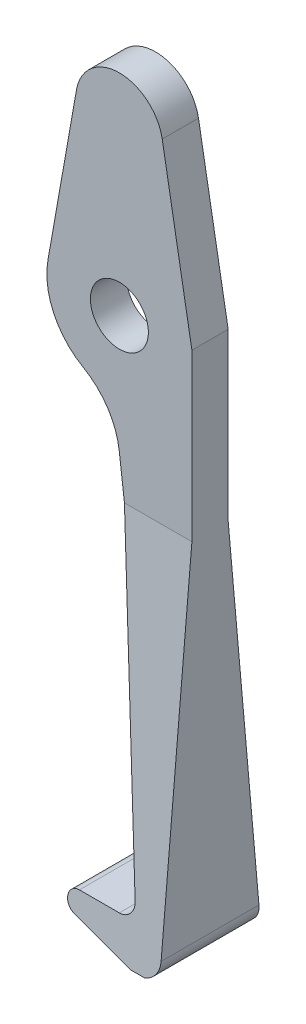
ISO-10303-21;
HEADER;
FILE_DESCRIPTION(('STEP AP214'),'2;1');
FILE_NAME('part.step','',(''),(''),'','','');
FILE_SCHEMA(('AUTOMOTIVE_DESIGN { 1 0 10303 214 1 1 1 1 }'));
ENDSEC;
DATA;
#1=APPLICATION_CONTEXT('core data for automotive mechanical design processes');
#2=APPLICATION_PROTOCOL_DEFINITION('international standard','automotive_design',2000,#1);
#3=PRODUCT_CONTEXT('',#1,'mechanical');
#4=PRODUCT('Part','Part','',(#3));
#5=PRODUCT_RELATED_PRODUCT_CATEGORY('part','',(#4));
#6=PRODUCT_DEFINITION_FORMATION('','',#4);
#7=PRODUCT_DEFINITION_CONTEXT('part definition',#1,'design');
#8=PRODUCT_DEFINITION('design','',#6,#7);
#9=PRODUCT_DEFINITION_SHAPE('','',#8);
#10=(LENGTH_UNIT() NAMED_UNIT(*) SI_UNIT(.MILLI.,.METRE.));
#11=(NAMED_UNIT(*) PLANE_ANGLE_UNIT() SI_UNIT($,.RADIAN.));
#12=(NAMED_UNIT(*) SI_UNIT($,.STERADIAN.) SOLID_ANGLE_UNIT());
#13=UNCERTAINTY_MEASURE_WITH_UNIT(LENGTH_MEASURE(1.E-05),#10,'distance_accuracy_value','');
#14=(GEOMETRIC_REPRESENTATION_CONTEXT(3) GLOBAL_UNCERTAINTY_ASSIGNED_CONTEXT((#13)) GLOBAL_UNIT_ASSIGNED_CONTEXT((#10,
#11,#12)) REPRESENTATION_CONTEXT('',''));
#15=CARTESIAN_POINT('',(0.,0.,0.));
#16=DIRECTION('',(0.,0.,1.));
#17=DIRECTION('',(1.,0.,0.));
#18=AXIS2_PLACEMENT_3D('',#15,#16,#17);
#19=CARTESIAN_POINT('',(7.,-70.,7.));
#20=DIRECTION('',(0.,0.,-1.));
#21=DIRECTION('',(-1.,0.,0.));
#22=AXIS2_PLACEMENT_3D('',#19,#20,#21);
#23=CYLINDRICAL_SURFACE('',#22,3.);
#24=CARTESIAN_POINT('',(7.,-70.,-6.74752285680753));
#25=DIRECTION('',(0.,0.0881456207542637,-0.996107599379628));
#26=DIRECTION('',(0.,-0.996107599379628,-0.0881456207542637));
#27=AXIS2_PLACEMENT_3D('',#24,#25,#26);
#28=ELLIPSE('',#27,3.01172283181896,3.);
#29=CARTESIAN_POINT('',(10.,-70.,-6.74752285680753));
#30=VERTEX_POINT('',#29);
#31=CARTESIAN_POINT('',(7.92705098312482,-72.8531695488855,-7.));
#32=VERTEX_POINT('',#31);
#33=EDGE_CURVE('E200',#30,#32,#28,.T.);
#34=ORIENTED_EDGE('',*,*,#33,.F.);
#35=DIRECTION('',(0.,0.,-1.));
#36=VECTOR('',#35,1.);
#37=CARTESIAN_POINT('',(10.,-70.,7.));
#38=LINE('',#37,#36);
#39=CARTESIAN_POINT('',(10.,-70.,6.74752285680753));
#40=VERTEX_POINT('',#39);
#41=EDGE_CURVE('E173',#40,#30,#38,.T.);
#42=ORIENTED_EDGE('',*,*,#41,.F.);
#43=CARTESIAN_POINT('',(7.,-70.,6.74752285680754));
#44=DIRECTION('',(0.,0.0881456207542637,0.996107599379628));
#45=DIRECTION('',(0.,0.996107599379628,-0.0881456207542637));
#46=AXIS2_PLACEMENT_3D('',#43,#44,#45);
#47=ELLIPSE('',#46,3.01172283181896,3.);
#48=CARTESIAN_POINT('',(7.92705098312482,-72.8531695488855,7.));
#49=VERTEX_POINT('',#48);
#50=EDGE_CURVE('E211',#49,#40,#47,.T.);
#51=ORIENTED_EDGE('',*,*,#50,.F.);
#52=DIRECTION('',(0.,0.,-1.));
#53=VECTOR('',#52,1.);
#54=CARTESIAN_POINT('',(7.92705098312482,-72.8531695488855,7.));
#55=LINE('',#54,#53);
#56=EDGE_CURVE('E185',#32,#49,#55,.F.);
#57=ORIENTED_EDGE('',*,*,#56,.F.);
#58=EDGE_LOOP('',(#34,#42,#51,#57));
#59=FACE_BOUND('',#58,.T.);
#60=ADVANCED_FACE('F41',(#59),#23,.T.);
#61=CARTESIAN_POINT('',(10.,0.876241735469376,7.));
#62=DIRECTION('',(-1.,0.,0.));
#63=DIRECTION('',(0.,-1.,0.));
#64=AXIS2_PLACEMENT_3D('',#61,#62,#63);
#65=PLANE('',#64);
#66=DIRECTION('',(0.,-0.996107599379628,0.0881456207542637));
#67=VECTOR('',#66,1.);
#68=CARTESIAN_POINT('',(10.,-22.,2.49999999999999));
#69=LINE('',#68,#67);
#70=CARTESIAN_POINT('',(10.,-22.,2.49999999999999));
#71=VERTEX_POINT('',#70);
#72=EDGE_CURVE('E157',#71,#40,#69,.T.);
#73=ORIENTED_EDGE('',*,*,#72,.T.);
#74=ORIENTED_EDGE('',*,*,#41,.T.);
#75=DIRECTION('',(0.,0.996107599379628,0.0881456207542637));
#76=VECTOR('',#75,1.);
#77=CARTESIAN_POINT('',(10.,-22.,-2.49999999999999));
#78=LINE('',#77,#76);
#79=CARTESIAN_POINT('',(10.,-22.,-2.49999999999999));
#80=VERTEX_POINT('',#79);
#81=EDGE_CURVE('E150',#30,#80,#78,.T.);
#82=ORIENTED_EDGE('',*,*,#81,.T.);
#83=DIRECTION('',(0.,1.,0.));
#84=VECTOR('',#83,1.);
#85=CARTESIAN_POINT('',(10.,29.,-2.5));
#86=LINE('',#85,#84);
#87=CARTESIAN_POINT('',(10.,0.876241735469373,-2.5));
#88=VERTEX_POINT('',#87);
#89=EDGE_CURVE('E160',#80,#88,#86,.T.);
#90=ORIENTED_EDGE('',*,*,#89,.T.);
#91=DIRECTION('',(0.,0.,-1.));
#92=VECTOR('',#91,1.);
#93=CARTESIAN_POINT('',(10.,0.876241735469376,7.));
#94=LINE('',#93,#92);
#95=CARTESIAN_POINT('',(10.,0.876241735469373,2.5));
#96=VERTEX_POINT('',#95);
#97=EDGE_CURVE('E262',#96,#88,#94,.T.);
#98=ORIENTED_EDGE('',*,*,#97,.F.);
#99=DIRECTION('',(0.,-1.,0.));
#100=VECTOR('',#99,1.);
#101=CARTESIAN_POINT('',(10.,29.,2.5));
#102=LINE('',#101,#100);
#103=EDGE_CURVE('E167',#96,#71,#102,.T.);
#104=ORIENTED_EDGE('',*,*,#103,.T.);
#105=EDGE_LOOP('',(#73,#74,#82,#90,#98,#104));
#106=FACE_BOUND('',#105,.T.);
#107=ADVANCED_FACE('F171',(#106),#65,.F.);
#108=CARTESIAN_POINT('',(5.90856607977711,24.0434782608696,7.));
#109=DIRECTION('',(-0.984761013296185,-0.173913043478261,0.));
#110=DIRECTION('',(0.173913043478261,-0.984761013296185,0.));
#111=AXIS2_PLACEMENT_3D('',#108,#109,#110);
#112=PLANE('',#111);
#113=DIRECTION('',(-0.173913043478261,0.984761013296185,0.));
#114=VECTOR('',#113,1.);
#115=CARTESIAN_POINT('',(5.90856607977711,24.0434782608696,2.5));
#116=LINE('',#115,#114);
#117=CARTESIAN_POINT('',(5.90856607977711,24.0434782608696,2.5));
#118=VERTEX_POINT('',#117);
#119=EDGE_CURVE('E64',#96,#118,#116,.T.);
#120=ORIENTED_EDGE('',*,*,#119,.F.);
#121=ORIENTED_EDGE('',*,*,#97,.T.);
#122=DIRECTION('',(0.173913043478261,-0.984761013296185,0.));
#123=VECTOR('',#122,1.);
#124=CARTESIAN_POINT('',(5.90856607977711,24.0434782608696,-2.5));
#125=LINE('',#124,#123);
#126=CARTESIAN_POINT('',(5.90856607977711,24.0434782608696,-2.5));
#127=VERTEX_POINT('',#126);
#128=EDGE_CURVE('E163',#127,#88,#125,.T.);
#129=ORIENTED_EDGE('',*,*,#128,.F.);
#130=DIRECTION('',(0.,0.,-1.));
#131=VECTOR('',#130,1.);
#132=CARTESIAN_POINT('',(5.90856607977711,24.0434782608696,7.));
#133=LINE('',#132,#131);
#134=EDGE_CURVE('E259',#118,#127,#133,.T.);
#135=ORIENTED_EDGE('',*,*,#134,.F.);
#136=EDGE_LOOP('',(#120,#121,#129,#135));
#137=FACE_BOUND('',#136,.T.);
#138=ADVANCED_FACE('F284',(#137),#112,.F.);
#139=CARTESIAN_POINT('',(0.,23.,7.));
#140=DIRECTION('',(0.,0.,-1.));
#141=DIRECTION('',(-1.,0.,0.));
#142=AXIS2_PLACEMENT_3D('',#139,#140,#141);
#143=CYLINDRICAL_SURFACE('',#142,6.);
#144=CARTESIAN_POINT('',(0.,23.,2.5));
#145=DIRECTION('',(0.,0.,1.));
#146=DIRECTION('',(0.,-1.,0.));
#147=AXIS2_PLACEMENT_3D('',#144,#145,#146);
#148=CIRCLE('',#147,6.);
#149=CARTESIAN_POINT('',(-5.90856607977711,24.0434782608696,2.5));
#150=VERTEX_POINT('',#149);
#151=EDGE_CURVE('E230',#118,#150,#148,.T.);
#152=ORIENTED_EDGE('',*,*,#151,.F.);
#153=ORIENTED_EDGE('',*,*,#134,.T.);
#154=CARTESIAN_POINT('',(0.,23.,-2.5));
#155=DIRECTION('',(0.,0.,-1.));
#156=DIRECTION('',(0.,1.,0.));
#157=AXIS2_PLACEMENT_3D('',#154,#155,#156);
#158=CIRCLE('',#157,6.);
#159=CARTESIAN_POINT('',(-5.90856607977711,24.0434782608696,-2.5));
#160=VERTEX_POINT('',#159);
#161=EDGE_CURVE('E221',#160,#127,#158,.T.);
#162=ORIENTED_EDGE('',*,*,#161,.F.);
#163=DIRECTION('',(0.,0.,-1.));
#164=VECTOR('',#163,1.);
#165=CARTESIAN_POINT('',(-5.90856607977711,24.0434782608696,7.));
#166=LINE('',#165,#164);
#167=EDGE_CURVE('E256',#150,#160,#166,.T.);
#168=ORIENTED_EDGE('',*,*,#167,.F.);
#169=EDGE_LOOP('',(#152,#153,#162,#168));
#170=FACE_BOUND('',#169,.T.);
#171=ADVANCED_FACE('F286',(#170),#143,.T.);
#172=CARTESIAN_POINT('',(-9.84761013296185,1.73913043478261,7.));
#173=DIRECTION('',(0.984761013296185,-0.173913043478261,0.));
#174=DIRECTION('',(0.173913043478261,0.984761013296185,0.));
#175=AXIS2_PLACEMENT_3D('',#172,#173,#174);
#176=PLANE('',#175);
#177=DIRECTION('',(-0.173913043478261,-0.984761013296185,0.));
#178=VECTOR('',#177,1.);
#179=CARTESIAN_POINT('',(-9.84761013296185,1.73913043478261,2.5));
#180=LINE('',#179,#178);
#181=CARTESIAN_POINT('',(-9.84761013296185,1.73913043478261,2.5));
#182=VERTEX_POINT('',#181);
#183=EDGE_CURVE('E228',#150,#182,#180,.T.);
#184=ORIENTED_EDGE('',*,*,#183,.F.);
#185=ORIENTED_EDGE('',*,*,#167,.T.);
#186=DIRECTION('',(0.173913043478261,0.984761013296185,0.));
#187=VECTOR('',#186,1.);
#188=CARTESIAN_POINT('',(-9.84761013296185,1.73913043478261,-2.5));
#189=LINE('',#188,#187);
#190=CARTESIAN_POINT('',(-9.84761013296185,1.73913043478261,-2.5));
#191=VERTEX_POINT('',#190);
#192=EDGE_CURVE('E218',#191,#160,#189,.T.);
#193=ORIENTED_EDGE('',*,*,#192,.F.);
#194=DIRECTION('',(0.,0.,-1.));
#195=VECTOR('',#194,1.);
#196=CARTESIAN_POINT('',(-9.84761013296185,1.73913043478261,7.));
#197=LINE('',#196,#195);
#198=EDGE_CURVE('E253',#182,#191,#197,.T.);
#199=ORIENTED_EDGE('',*,*,#198,.F.);
#200=EDGE_LOOP('',(#184,#185,#193,#199));
#201=FACE_BOUND('',#200,.T.);
#202=ADVANCED_FACE('F292',(#201),#176,.F.);
#203=CARTESIAN_POINT('',(0.,0.,7.));
#204=DIRECTION('',(0.,0.,-1.));
#205=DIRECTION('',(-1.,0.,0.));
#206=AXIS2_PLACEMENT_3D('',#203,#204,#205);
#207=CYLINDRICAL_SURFACE('',#206,10.);
#208=CARTESIAN_POINT('',(0.,0.,2.5));
#209=DIRECTION('',(0.,0.,1.));
#210=DIRECTION('',(0.,-1.,0.));
#211=AXIS2_PLACEMENT_3D('',#208,#209,#210);
#212=CIRCLE('',#211,10.);
#213=CARTESIAN_POINT('',(-4.97477123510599,-8.67477095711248,2.5));
#214=VERTEX_POINT('',#213);
#215=EDGE_CURVE('E226',#182,#214,#212,.T.);
#216=ORIENTED_EDGE('',*,*,#215,.F.);
#217=ORIENTED_EDGE('',*,*,#198,.T.);
#218=CARTESIAN_POINT('',(0.,0.,-2.5));
#219=DIRECTION('',(0.,0.,-1.));
#220=DIRECTION('',(0.,1.,0.));
#221=AXIS2_PLACEMENT_3D('',#218,#219,#220);
#222=CIRCLE('',#221,10.);
#223=CARTESIAN_POINT('',(-4.97477123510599,-8.67477095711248,-2.5));
#224=VERTEX_POINT('',#223);
#225=EDGE_CURVE('E216',#224,#191,#222,.T.);
#226=ORIENTED_EDGE('',*,*,#225,.F.);
#227=DIRECTION('',(0.,0.,-1.));
#228=VECTOR('',#227,1.);
#229=CARTESIAN_POINT('',(-4.97477123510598,-8.67477095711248,7.));
#230=LINE('',#229,#228);
#231=EDGE_CURVE('E250',#214,#224,#230,.T.);
#232=ORIENTED_EDGE('',*,*,#231,.F.);
#233=EDGE_LOOP('',(#216,#217,#226,#232));
#234=FACE_BOUND('',#233,.T.);
#235=ADVANCED_FACE('F295',(#234),#207,.T.);
#236=CARTESIAN_POINT('',(-9.94954247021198,-17.349541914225,7.));
#237=DIRECTION('',(0.,0.,-1.));
#238=DIRECTION('',(-1.,0.,0.));
#239=AXIS2_PLACEMENT_3D('',#236,#237,#238);
#240=CYLINDRICAL_SURFACE('',#239,10.);
#241=CARTESIAN_POINT('',(-9.94954247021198,-17.349541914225,2.49999999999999));
#242=DIRECTION('',(0.,0.,1.));
#243=DIRECTION('',(0.,-1.,0.));
#244=AXIS2_PLACEMENT_3D('',#241,#242,#243);
#245=CIRCLE('',#244,10.);
#246=CARTESIAN_POINT('',(-0.0240809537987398,-16.1308484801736,2.49999999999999));
#247=VERTEX_POINT('',#246);
#248=EDGE_CURVE('E224',#214,#247,#245,.F.);
#249=ORIENTED_EDGE('',*,*,#248,.F.);
#250=ORIENTED_EDGE('',*,*,#231,.T.);
#251=CARTESIAN_POINT('',(-9.94954247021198,-17.349541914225,-2.49999999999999));
#252=DIRECTION('',(0.,0.,-1.));
#253=DIRECTION('',(0.,1.,0.));
#254=AXIS2_PLACEMENT_3D('',#251,#252,#253);
#255=CIRCLE('',#254,10.);
#256=CARTESIAN_POINT('',(-0.0240809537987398,-16.1308484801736,-2.49999999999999));
#257=VERTEX_POINT('',#256);
#258=EDGE_CURVE('E213',#257,#224,#255,.F.);
#259=ORIENTED_EDGE('',*,*,#258,.F.);
#260=DIRECTION('',(0.,0.,-1.));
#261=VECTOR('',#260,1.);
#262=CARTESIAN_POINT('',(-0.0240809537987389,-16.1308484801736,7.));
#263=LINE('',#262,#261);
#264=EDGE_CURVE('E247',#247,#257,#263,.T.);
#265=ORIENTED_EDGE('',*,*,#264,.F.);
#266=EDGE_LOOP('',(#249,#250,#259,#265));
#267=FACE_BOUND('',#266,.T.);
#268=ADVANCED_FACE('F270',(#267),#240,.F.);
#269=CARTESIAN_POINT('',(5.98509230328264,-65.0716372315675,7.));
#270=DIRECTION('',(0.992546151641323,0.121869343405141,0.));
#271=DIRECTION('',(-0.121869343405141,0.992546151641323,0.));
#272=AXIS2_PLACEMENT_3D('',#269,#270,#271);
#273=PLANE('',#272);
#274=DIRECTION('',(0.121401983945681,-0.988739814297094,0.0874936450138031));
#275=VECTOR('',#274,1.);
#276=CARTESIAN_POINT('',(5.99240642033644,-65.1312059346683,6.31668298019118));
#277=LINE('',#276,#275);
#278=CARTESIAN_POINT('',(0.696560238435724,-22.,2.49999999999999));
#279=VERTEX_POINT('',#278);
#280=CARTESIAN_POINT('',(5.98509230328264,-65.0716372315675,6.31141174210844));
#281=VERTEX_POINT('',#280);
#282=EDGE_CURVE('E209',#279,#281,#277,.T.);
#283=ORIENTED_EDGE('',*,*,#282,.F.);
#284=DIRECTION('',(0.121869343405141,-0.992546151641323,0.));
#285=VECTOR('',#284,1.);
#286=CARTESIAN_POINT('',(5.98509230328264,-65.0716372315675,2.49999999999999));
#287=LINE('',#286,#285);
#288=EDGE_CURVE('E12',#247,#279,#287,.T.);
#289=ORIENTED_EDGE('',*,*,#288,.F.);
#290=ORIENTED_EDGE('',*,*,#264,.T.);
#291=DIRECTION('',(-0.121869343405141,0.992546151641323,0.));
#292=VECTOR('',#291,1.);
#293=CARTESIAN_POINT('',(5.98509230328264,-65.0716372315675,-2.49999999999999));
#294=LINE('',#293,#292);
#295=CARTESIAN_POINT('',(0.696560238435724,-22.,-2.49999999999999));
#296=VERTEX_POINT('',#295);
#297=EDGE_CURVE('E49',#296,#257,#294,.T.);
#298=ORIENTED_EDGE('',*,*,#297,.F.);
#299=DIRECTION('',(-0.121401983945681,0.988739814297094,0.0874936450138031));
#300=VECTOR('',#299,1.);
#301=CARTESIAN_POINT('',(5.84369979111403,-63.9200876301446,-6.20951104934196));
#302=LINE('',#301,#300);
#303=CARTESIAN_POINT('',(5.98509230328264,-65.0716372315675,-6.31141174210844));
#304=VERTEX_POINT('',#303);
#305=EDGE_CURVE('E153',#304,#296,#302,.T.);
#306=ORIENTED_EDGE('',*,*,#305,.F.);
#307=DIRECTION('',(0.,0.,-1.));
#308=VECTOR('',#307,1.);
#309=CARTESIAN_POINT('',(5.98509230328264,-65.0716372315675,7.));
#310=LINE('',#309,#308);
#311=EDGE_CURVE('E244',#281,#304,#310,.T.);
#312=ORIENTED_EDGE('',*,*,#311,.F.);
#313=EDGE_LOOP('',(#283,#289,#290,#298,#306,#312));
#314=FACE_BOUND('',#313,.T.);
#315=ADVANCED_FACE('F274',(#314),#273,.F.);
#316=CARTESIAN_POINT('',(4.,-65.3153759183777,7.));
#317=DIRECTION('',(0.,0.,-1.));
#318=DIRECTION('',(-1.,0.,0.));
#319=AXIS2_PLACEMENT_3D('',#316,#317,#318);
#320=CYLINDRICAL_SURFACE('',#319,2.);
#321=CARTESIAN_POINT('',(4.,-65.3153759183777,-6.33298019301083));
#322=DIRECTION('',(0.,0.0881456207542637,-0.996107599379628));
#323=DIRECTION('',(0.,-0.996107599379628,-0.0881456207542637));
#324=AXIS2_PLACEMENT_3D('',#321,#322,#323);
#325=ELLIPSE('',#324,2.00781522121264,2.);
#326=CARTESIAN_POINT('',(4.,-67.3153759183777,-6.50996031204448));
#327=VERTEX_POINT('',#326);
#328=EDGE_CURVE('E197',#327,#304,#325,.F.);
#329=ORIENTED_EDGE('',*,*,#328,.F.);
#330=DIRECTION('',(0.,0.,-1.));
#331=VECTOR('',#330,1.);
#332=CARTESIAN_POINT('',(4.,-67.3153759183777,7.));
#333=LINE('',#332,#331);
#334=CARTESIAN_POINT('',(4.,-67.3153759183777,6.50996031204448));
#335=VERTEX_POINT('',#334);
#336=EDGE_CURVE('E241',#335,#327,#333,.T.);
#337=ORIENTED_EDGE('',*,*,#336,.F.);
#338=CARTESIAN_POINT('',(4.,-65.3153759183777,6.33298019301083));
#339=DIRECTION('',(0.,0.0881456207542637,0.996107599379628));
#340=DIRECTION('',(0.,0.996107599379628,-0.0881456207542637));
#341=AXIS2_PLACEMENT_3D('',#338,#339,#340);
#342=ELLIPSE('',#341,2.00781522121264,2.);
#343=EDGE_CURVE('E207',#281,#335,#342,.F.);
#344=ORIENTED_EDGE('',*,*,#343,.F.);
#345=ORIENTED_EDGE('',*,*,#311,.T.);
#346=EDGE_LOOP('',(#329,#337,#344,#345));
#347=FACE_BOUND('',#346,.T.);
#348=ADVANCED_FACE('F330',(#347),#320,.F.);
#349=CARTESIAN_POINT('',(-1.5,-67.3153759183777,7.));
#350=DIRECTION('',(0.,-1.,0.));
#351=DIRECTION('',(1.,0.,0.));
#352=AXIS2_PLACEMENT_3D('',#349,#350,#351);
#353=PLANE('',#352);
#354=DIRECTION('',(1.,0.,0.));
#355=VECTOR('',#354,1.);
#356=CARTESIAN_POINT('',(-1.5,-67.3153759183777,-6.50996031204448));
#357=LINE('',#356,#355);
#358=CARTESIAN_POINT('',(-1.5,-67.3153759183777,-6.50996031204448));
#359=VERTEX_POINT('',#358);
#360=EDGE_CURVE('E195',#359,#327,#357,.T.);
#361=ORIENTED_EDGE('',*,*,#360,.F.);
#362=DIRECTION('',(0.,0.,-1.));
#363=VECTOR('',#362,1.);
#364=CARTESIAN_POINT('',(-1.5,-67.3153759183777,7.));
#365=LINE('',#364,#363);
#366=CARTESIAN_POINT('',(-1.5,-67.3153759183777,6.50996031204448));
#367=VERTEX_POINT('',#366);
#368=EDGE_CURVE('E238',#367,#359,#365,.T.);
#369=ORIENTED_EDGE('',*,*,#368,.F.);
#370=DIRECTION('',(-1.,0.,0.));
#371=VECTOR('',#370,1.);
#372=CARTESIAN_POINT('',(-1.50000000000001,-67.3153759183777,6.50996031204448));
#373=LINE('',#372,#371);
#374=EDGE_CURVE('E205',#335,#367,#373,.T.);
#375=ORIENTED_EDGE('',*,*,#374,.F.);
#376=ORIENTED_EDGE('',*,*,#336,.T.);
#377=EDGE_LOOP('',(#361,#369,#375,#376));
#378=FACE_BOUND('',#377,.T.);
#379=ADVANCED_FACE('F326',(#378),#353,.F.);
#380=CARTESIAN_POINT('',(-1.5,-68.8153759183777,7.));
#381=DIRECTION('',(0.,0.,-1.));
#382=DIRECTION('',(-1.,0.,0.));
#383=AXIS2_PLACEMENT_3D('',#380,#381,#382);
#384=CYLINDRICAL_SURFACE('',#383,1.50000000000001);
#385=CARTESIAN_POINT('',(-1.5,-68.8153759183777,-6.64269540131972));
#386=DIRECTION('',(0.,0.0881456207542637,-0.996107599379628));
#387=DIRECTION('',(0.,-0.996107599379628,-0.0881456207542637));
#388=AXIS2_PLACEMENT_3D('',#385,#386,#387);
#389=ELLIPSE('',#388,1.50586141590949,1.50000000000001);
#390=CARTESIAN_POINT('',(-1.9635254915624,-70.2419606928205,-6.76893397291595));
#391=VERTEX_POINT('',#390);
#392=EDGE_CURVE('E193',#391,#359,#389,.T.);
#393=ORIENTED_EDGE('',*,*,#392,.F.);
#394=DIRECTION('',(0.,0.,-1.));
#395=VECTOR('',#394,1.);
#396=CARTESIAN_POINT('',(-1.9635254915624,-70.2419606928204,7.));
#397=LINE('',#396,#395);
#398=CARTESIAN_POINT('',(-1.96352549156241,-70.2419606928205,6.76893397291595));
#399=VERTEX_POINT('',#398);
#400=EDGE_CURVE('E235',#399,#391,#397,.T.);
#401=ORIENTED_EDGE('',*,*,#400,.F.);
#402=CARTESIAN_POINT('',(-1.5,-68.8153759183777,6.64269540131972));
#403=DIRECTION('',(0.,0.0881456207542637,0.996107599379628));
#404=DIRECTION('',(0.,0.996107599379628,-0.0881456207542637));
#405=AXIS2_PLACEMENT_3D('',#402,#403,#404);
#406=ELLIPSE('',#405,1.50586141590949,1.50000000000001);
#407=EDGE_CURVE('E56',#367,#399,#406,.T.);
#408=ORIENTED_EDGE('',*,*,#407,.F.);
#409=ORIENTED_EDGE('',*,*,#368,.T.);
#410=EDGE_LOOP('',(#393,#401,#408,#409));
#411=FACE_BOUND('',#410,.T.);
#412=ADVANCED_FACE('F322',(#411),#384,.T.);
#413=CARTESIAN_POINT('',(6.07294901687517,-72.8531695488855,7.));
#414=DIRECTION('',(0.30901699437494,0.951056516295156,0.));
#415=DIRECTION('',(-0.951056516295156,0.30901699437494,0.));
#416=AXIS2_PLACEMENT_3D('',#413,#414,#415);
#417=PLANE('',#416);
#418=DIRECTION('',(-0.950701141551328,0.308901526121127,0.0273347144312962));
#419=VECTOR('',#418,1.);
#420=CARTESIAN_POINT('',(5.70912899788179,-72.7349572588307,-6.98953938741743));
#421=LINE('',#420,#419);
#422=CARTESIAN_POINT('',(6.07294901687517,-72.8531695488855,-7.));
#423=VERTEX_POINT('',#422);
#424=EDGE_CURVE('E191',#423,#391,#421,.T.);
#425=ORIENTED_EDGE('',*,*,#424,.F.);
#426=DIRECTION('',(0.,0.,-1.));
#427=VECTOR('',#426,1.);
#428=CARTESIAN_POINT('',(6.07294901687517,-72.8531695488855,7.));
#429=LINE('',#428,#427);
#430=CARTESIAN_POINT('',(6.07294901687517,-72.8531695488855,7.));
#431=VERTEX_POINT('',#430);
#432=EDGE_CURVE('E233',#431,#423,#429,.T.);
#433=ORIENTED_EDGE('',*,*,#432,.F.);
#434=DIRECTION('',(0.950701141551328,-0.308901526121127,0.0273347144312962));
#435=VECTOR('',#434,1.);
#436=CARTESIAN_POINT('',(6.07294901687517,-72.8531695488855,7.));
#437=LINE('',#436,#435);
#438=EDGE_CURVE('E202',#399,#431,#437,.T.);
#439=ORIENTED_EDGE('',*,*,#438,.F.);
#440=ORIENTED_EDGE('',*,*,#400,.T.);
#441=EDGE_LOOP('',(#425,#433,#439,#440));
#442=FACE_BOUND('',#441,.T.);
#443=ADVANCED_FACE('F317',(#442),#417,.F.);
#444=CARTESIAN_POINT('',(-10.,29.,2.5));
#445=DIRECTION('',(0.,0.,1.));
#446=DIRECTION('',(0.,-1.,0.));
#447=AXIS2_PLACEMENT_3D('',#444,#445,#446);
#448=PLANE('',#447);
#449=CARTESIAN_POINT('',(0.,0.,2.5));
#450=DIRECTION('',(0.,0.,1.));
#451=DIRECTION('',(1.,0.,0.));
#452=AXIS2_PLACEMENT_3D('',#449,#450,#451);
#453=CIRCLE('',#452,3.99999999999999);
#454=CARTESIAN_POINT('',(3.99999999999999,0.,2.5));
#455=VERTEX_POINT('',#454);
#456=EDGE_CURVE('E176',#455,#455,#453,.T.);
#457=ORIENTED_EDGE('',*,*,#456,.F.);
#458=EDGE_LOOP('',(#457));
#459=FACE_BOUND('',#458,.T.);
#460=ORIENTED_EDGE('',*,*,#119,.T.);
#461=ORIENTED_EDGE('',*,*,#151,.T.);
#462=ORIENTED_EDGE('',*,*,#183,.T.);
#463=ORIENTED_EDGE('',*,*,#215,.T.);
#464=ORIENTED_EDGE('',*,*,#248,.T.);
#465=ORIENTED_EDGE('',*,*,#288,.T.);
#466=DIRECTION('',(1.,0.,0.));
#467=VECTOR('',#466,1.);
#468=CARTESIAN_POINT('',(-10.,-22.,2.49999999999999));
#469=LINE('',#468,#467);
#470=EDGE_CURVE('E156',#279,#71,#469,.T.);
#471=ORIENTED_EDGE('',*,*,#470,.T.);
#472=ORIENTED_EDGE('',*,*,#103,.F.);
#473=EDGE_LOOP('',(#460,#461,#462,#463,#464,#465,#471,#472));
#474=FACE_BOUND('',#473,.T.);
#475=ADVANCED_FACE('F277',(#459,#474),#448,.T.);
#476=CARTESIAN_POINT('',(-10.,29.,-2.5));
#477=DIRECTION('',(0.,0.,-1.));
#478=DIRECTION('',(0.,1.,0.));
#479=AXIS2_PLACEMENT_3D('',#476,#477,#478);
#480=PLANE('',#479);
#481=CARTESIAN_POINT('',(0.,0.,-2.5));
#482=DIRECTION('',(0.,0.,-1.));
#483=DIRECTION('',(0.,1.,0.));
#484=AXIS2_PLACEMENT_3D('',#481,#482,#483);
#485=CIRCLE('',#484,3.99999999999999);
#486=CARTESIAN_POINT('',(0.,3.99999999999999,-2.5));
#487=VERTEX_POINT('',#486);
#488=EDGE_CURVE('E44',#487,#487,#485,.T.);
#489=ORIENTED_EDGE('',*,*,#488,.F.);
#490=EDGE_LOOP('',(#489));
#491=FACE_BOUND('',#490,.T.);
#492=ORIENTED_EDGE('',*,*,#128,.T.);
#493=ORIENTED_EDGE('',*,*,#89,.F.);
#494=DIRECTION('',(1.,0.,0.));
#495=VECTOR('',#494,1.);
#496=CARTESIAN_POINT('',(-10.,-22.,-2.49999999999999));
#497=LINE('',#496,#495);
#498=EDGE_CURVE('E146',#296,#80,#497,.T.);
#499=ORIENTED_EDGE('',*,*,#498,.F.);
#500=ORIENTED_EDGE('',*,*,#297,.T.);
#501=ORIENTED_EDGE('',*,*,#258,.T.);
#502=ORIENTED_EDGE('',*,*,#225,.T.);
#503=ORIENTED_EDGE('',*,*,#192,.T.);
#504=ORIENTED_EDGE('',*,*,#161,.T.);
#505=EDGE_LOOP('',(#492,#493,#499,#500,#501,#502,#503,#504));
#506=FACE_BOUND('',#505,.T.);
#507=ADVANCED_FACE('F161',(#491,#506),#480,.T.);
#508=CARTESIAN_POINT('',(-10.,-22.,2.49999999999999));
#509=DIRECTION('',(0.,0.0881456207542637,0.996107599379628));
#510=DIRECTION('',(0.,-0.996107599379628,0.0881456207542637));
#511=AXIS2_PLACEMENT_3D('',#508,#509,#510);
#512=PLANE('',#511);
#513=ORIENTED_EDGE('',*,*,#50,.T.);
#514=ORIENTED_EDGE('',*,*,#72,.F.);
#515=ORIENTED_EDGE('',*,*,#470,.F.);
#516=ORIENTED_EDGE('',*,*,#282,.T.);
#517=ORIENTED_EDGE('',*,*,#343,.T.);
#518=ORIENTED_EDGE('',*,*,#374,.T.);
#519=ORIENTED_EDGE('',*,*,#407,.T.);
#520=ORIENTED_EDGE('',*,*,#438,.T.);
#521=DIRECTION('',(1.,0.,0.));
#522=VECTOR('',#521,1.);
#523=CARTESIAN_POINT('',(-10.,-72.8531695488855,7.));
#524=LINE('',#523,#522);
#525=EDGE_CURVE('E186',#431,#49,#524,.T.);
#526=ORIENTED_EDGE('',*,*,#525,.T.);
#527=EDGE_LOOP('',(#513,#514,#515,#516,#517,#518,#519,#520,#526));
#528=FACE_BOUND('',#527,.T.);
#529=ADVANCED_FACE('F279',(#528),#512,.T.);
#530=CARTESIAN_POINT('',(-10.,-22.,-2.49999999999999));
#531=DIRECTION('',(0.,0.0881456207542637,-0.996107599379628));
#532=DIRECTION('',(0.,0.996107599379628,0.0881456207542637));
#533=AXIS2_PLACEMENT_3D('',#530,#531,#532);
#534=PLANE('',#533);
#535=ORIENTED_EDGE('',*,*,#33,.T.);
#536=DIRECTION('',(1.,0.,0.));
#537=VECTOR('',#536,1.);
#538=CARTESIAN_POINT('',(-10.,-72.8531695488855,-7.));
#539=LINE('',#538,#537);
#540=EDGE_CURVE('E182',#423,#32,#539,.T.);
#541=ORIENTED_EDGE('',*,*,#540,.F.);
#542=ORIENTED_EDGE('',*,*,#424,.T.);
#543=ORIENTED_EDGE('',*,*,#392,.T.);
#544=ORIENTED_EDGE('',*,*,#360,.T.);
#545=ORIENTED_EDGE('',*,*,#328,.T.);
#546=ORIENTED_EDGE('',*,*,#305,.T.);
#547=ORIENTED_EDGE('',*,*,#498,.T.);
#548=ORIENTED_EDGE('',*,*,#81,.F.);
#549=EDGE_LOOP('',(#535,#541,#542,#543,#544,#545,#546,#547,#548));
#550=FACE_BOUND('',#549,.T.);
#551=ADVANCED_FACE('F148',(#550),#534,.T.);
#552=CARTESIAN_POINT('',(-10.,-72.8531695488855,7.));
#553=DIRECTION('',(0.,-1.,0.));
#554=DIRECTION('',(0.,0.,-1.));
#555=AXIS2_PLACEMENT_3D('',#552,#553,#554);
#556=PLANE('',#555);
#557=ORIENTED_EDGE('',*,*,#56,.T.);
#558=ORIENTED_EDGE('',*,*,#525,.F.);
#559=ORIENTED_EDGE('',*,*,#432,.T.);
#560=ORIENTED_EDGE('',*,*,#540,.T.);
#561=EDGE_LOOP('',(#557,#558,#559,#560));
#562=FACE_BOUND('',#561,.T.);
#563=ADVANCED_FACE('F313',(#562),#556,.T.);
#564=CARTESIAN_POINT('',(0.,0.,2.5));
#565=DIRECTION('',(0.,0.,1.));
#566=DIRECTION('',(1.,0.,0.));
#567=AXIS2_PLACEMENT_3D('',#564,#565,#566);
#568=CYLINDRICAL_SURFACE('',#567,3.99999999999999);
#569=ORIENTED_EDGE('',*,*,#488,.T.);
#570=EDGE_LOOP('',(#569));
#571=FACE_BOUND('',#570,.T.);
#572=ORIENTED_EDGE('',*,*,#456,.T.);
#573=EDGE_LOOP('',(#572));
#574=FACE_BOUND('',#573,.T.);
#575=ADVANCED_FACE('F356',(#571,#574),#568,.F.);
#576=CLOSED_SHELL('',(#60,#107,#138,#171,#202,#235,#268,#315,#348,#379,#412,#443,#475,#507,#529,
#551,#563,#575));
#577=MANIFOLD_SOLID_BREP('B2',#576);
#578=ADVANCED_BREP_SHAPE_REPRESENTATION('',(#18,#577),#14);
#579=SHAPE_DEFINITION_REPRESENTATION(#9,#578);
ENDSEC;
END-ISO-10303-21;
